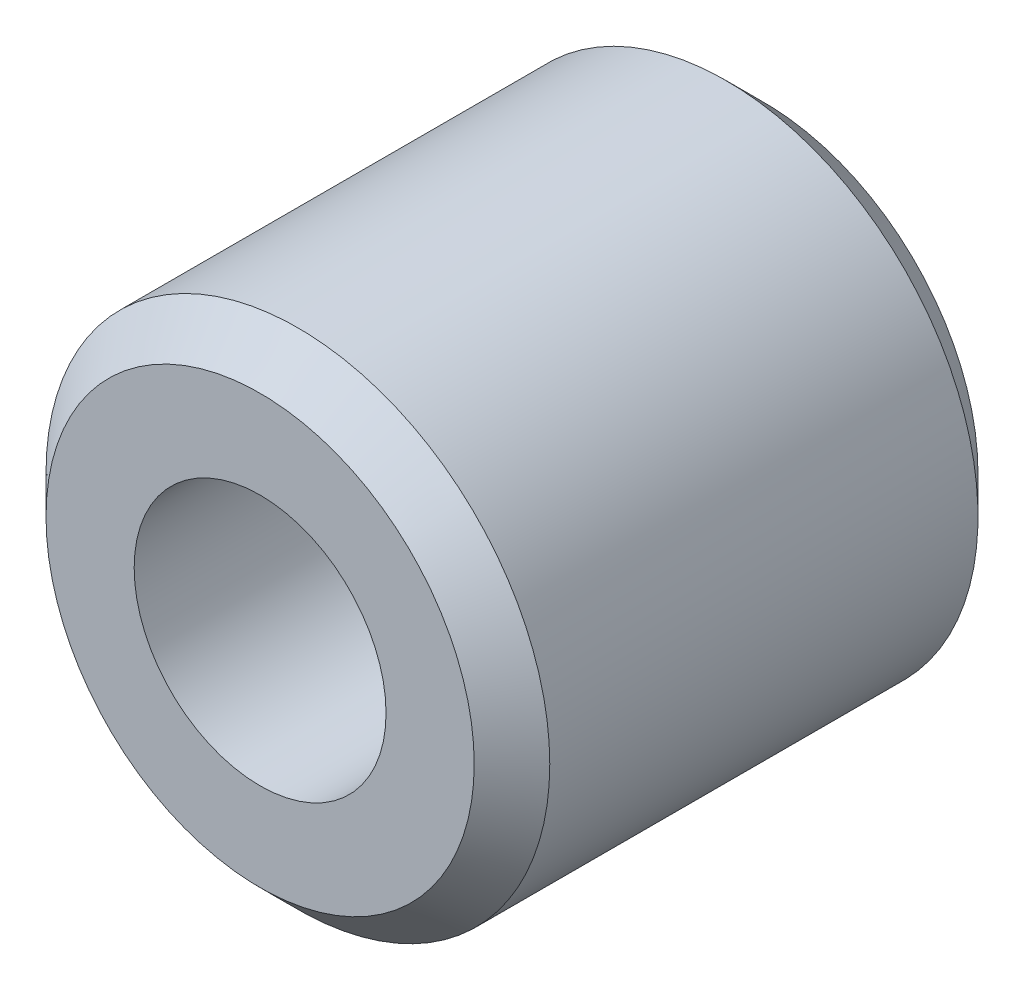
ISO-10303-21;
HEADER;
FILE_DESCRIPTION(('STEP AP214'),'2;1');
FILE_NAME('part.step','',(''),(''),'','','');
FILE_SCHEMA(('AUTOMOTIVE_DESIGN { 1 0 10303 214 1 1 1 1 }'));
ENDSEC;
DATA;
#1=APPLICATION_CONTEXT('core data for automotive mechanical design processes');
#2=APPLICATION_PROTOCOL_DEFINITION('international standard','automotive_design',2000,#1);
#3=PRODUCT_CONTEXT('',#1,'mechanical');
#4=PRODUCT('Part','Part','',(#3));
#5=PRODUCT_RELATED_PRODUCT_CATEGORY('part','',(#4));
#6=PRODUCT_DEFINITION_FORMATION('','',#4);
#7=PRODUCT_DEFINITION_CONTEXT('part definition',#1,'design');
#8=PRODUCT_DEFINITION('design','',#6,#7);
#9=PRODUCT_DEFINITION_SHAPE('','',#8);
#10=(LENGTH_UNIT() NAMED_UNIT(*) SI_UNIT(.MILLI.,.METRE.));
#11=(NAMED_UNIT(*) PLANE_ANGLE_UNIT() SI_UNIT($,.RADIAN.));
#12=(NAMED_UNIT(*) SI_UNIT($,.STERADIAN.) SOLID_ANGLE_UNIT());
#13=UNCERTAINTY_MEASURE_WITH_UNIT(LENGTH_MEASURE(1.E-05),#10,'distance_accuracy_value','');
#14=(GEOMETRIC_REPRESENTATION_CONTEXT(3) GLOBAL_UNCERTAINTY_ASSIGNED_CONTEXT((#13)) GLOBAL_UNIT_ASSIGNED_CONTEXT((#10,
#11,#12)) REPRESENTATION_CONTEXT('',''));
#15=CARTESIAN_POINT('',(0.,0.,0.));
#16=DIRECTION('',(0.,0.,1.));
#17=DIRECTION('',(1.,0.,0.));
#18=AXIS2_PLACEMENT_3D('',#15,#16,#17);
#19=CARTESIAN_POINT('',(0.,0.,0.));
#20=DIRECTION('',(0.,0.,-1.));
#21=DIRECTION('',(-1.,0.,0.));
#22=AXIS2_PLACEMENT_3D('',#19,#20,#21);
#23=CYLINDRICAL_SURFACE('',#22,3.);
#24=CARTESIAN_POINT('',(0.,0.,0.));
#25=DIRECTION('',(0.,0.,-1.));
#26=DIRECTION('',(-1.,0.,0.));
#27=AXIS2_PLACEMENT_3D('',#24,#25,#26);
#28=CIRCLE('',#27,3.);
#29=CARTESIAN_POINT('',(-3.,0.,0.));
#30=VERTEX_POINT('',#29);
#31=EDGE_CURVE('E34',#30,#30,#28,.T.);
#32=ORIENTED_EDGE('',*,*,#31,.T.);
#33=EDGE_LOOP('',(#32));
#34=FACE_BOUND('',#33,.T.);
#35=CARTESIAN_POINT('',(0.,0.,12.));
#36=DIRECTION('',(0.,0.,-1.));
#37=DIRECTION('',(-1.,0.,0.));
#38=AXIS2_PLACEMENT_3D('',#35,#36,#37);
#39=CIRCLE('',#38,3.);
#40=CARTESIAN_POINT('',(-3.,0.,12.));
#41=VERTEX_POINT('',#40);
#42=EDGE_CURVE('E31',#41,#41,#39,.T.);
#43=ORIENTED_EDGE('',*,*,#42,.F.);
#44=EDGE_LOOP('',(#43));
#45=FACE_BOUND('',#44,.T.);
#46=ADVANCED_FACE('F12',(#34,#45),#23,.F.);
#47=CARTESIAN_POINT('',(-3.,0.,12.));
#48=DIRECTION('',(0.,0.,1.));
#49=DIRECTION('',(1.,0.,0.));
#50=AXIS2_PLACEMENT_3D('',#47,#48,#49);
#51=PLANE('',#50);
#52=CARTESIAN_POINT('',(0.,0.,12.));
#53=DIRECTION('',(0.,0.,1.));
#54=DIRECTION('',(1.,0.,0.));
#55=AXIS2_PLACEMENT_3D('',#52,#53,#54);
#56=CIRCLE('',#55,5.1);
#57=CARTESIAN_POINT('',(5.1,0.,12.));
#58=VERTEX_POINT('',#57);
#59=EDGE_CURVE('E8',#58,#58,#56,.T.);
#60=ORIENTED_EDGE('',*,*,#59,.T.);
#61=EDGE_LOOP('',(#60));
#62=FACE_BOUND('',#61,.T.);
#63=ORIENTED_EDGE('',*,*,#42,.T.);
#64=EDGE_LOOP('',(#63));
#65=FACE_BOUND('',#64,.T.);
#66=ADVANCED_FACE('F55',(#62,#65),#51,.T.);
#67=CARTESIAN_POINT('',(0.,0.,0.));
#68=DIRECTION('',(0.,0.,-1.));
#69=DIRECTION('',(-1.,0.,0.));
#70=AXIS2_PLACEMENT_3D('',#67,#68,#69);
#71=CYLINDRICAL_SURFACE('',#70,6.);
#72=CARTESIAN_POINT('',(0.,0.,0.899999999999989));
#73=DIRECTION('',(0.,0.,-1.));
#74=DIRECTION('',(-1.,0.,0.));
#75=AXIS2_PLACEMENT_3D('',#72,#73,#74);
#76=CIRCLE('',#75,6.);
#77=CARTESIAN_POINT('',(-6.,0.,0.899999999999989));
#78=VERTEX_POINT('',#77);
#79=EDGE_CURVE('E18',#78,#78,#76,.F.);
#80=ORIENTED_EDGE('',*,*,#79,.T.);
#81=EDGE_LOOP('',(#80));
#82=FACE_BOUND('',#81,.T.);
#83=CARTESIAN_POINT('',(0.,0.,11.1));
#84=DIRECTION('',(0.,0.,1.));
#85=DIRECTION('',(1.,0.,0.));
#86=AXIS2_PLACEMENT_3D('',#83,#84,#85);
#87=CIRCLE('',#86,6.);
#88=CARTESIAN_POINT('',(6.,0.,11.1));
#89=VERTEX_POINT('',#88);
#90=EDGE_CURVE('E22',#89,#89,#87,.F.);
#91=ORIENTED_EDGE('',*,*,#90,.T.);
#92=EDGE_LOOP('',(#91));
#93=FACE_BOUND('',#92,.T.);
#94=ADVANCED_FACE('F43',(#82,#93),#71,.T.);
#95=CARTESIAN_POINT('',(-3.,0.,0.));
#96=DIRECTION('',(0.,0.,-1.));
#97=DIRECTION('',(-1.,0.,0.));
#98=AXIS2_PLACEMENT_3D('',#95,#96,#97);
#99=PLANE('',#98);
#100=CARTESIAN_POINT('',(0.,0.,0.));
#101=DIRECTION('',(0.,0.,-1.));
#102=DIRECTION('',(-1.,0.,0.));
#103=AXIS2_PLACEMENT_3D('',#100,#101,#102);
#104=CIRCLE('',#103,5.1);
#105=CARTESIAN_POINT('',(-5.1,0.,0.));
#106=VERTEX_POINT('',#105);
#107=EDGE_CURVE('E26',#106,#106,#104,.T.);
#108=ORIENTED_EDGE('',*,*,#107,.T.);
#109=EDGE_LOOP('',(#108));
#110=FACE_BOUND('',#109,.T.);
#111=ORIENTED_EDGE('',*,*,#31,.F.);
#112=EDGE_LOOP('',(#111));
#113=FACE_BOUND('',#112,.T.);
#114=ADVANCED_FACE('F40',(#110,#113),#99,.T.);
#115=CARTESIAN_POINT('',(0.,0.,0.));
#116=DIRECTION('',(0.,0.,1.));
#117=DIRECTION('',(1.,0.,0.));
#118=AXIS2_PLACEMENT_3D('',#115,#116,#117);
#119=CONICAL_SURFACE('',#118,5.1,0.785398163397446);
#120=ORIENTED_EDGE('',*,*,#79,.F.);
#121=EDGE_LOOP('',(#120));
#122=FACE_BOUND('',#121,.T.);
#123=ORIENTED_EDGE('',*,*,#107,.F.);
#124=EDGE_LOOP('',(#123));
#125=FACE_BOUND('',#124,.T.);
#126=ADVANCED_FACE('F42',(#122,#125),#119,.T.);
#127=CARTESIAN_POINT('',(0.,0.,11.1));
#128=DIRECTION('',(0.,0.,-1.));
#129=DIRECTION('',(-1.,0.,0.));
#130=AXIS2_PLACEMENT_3D('',#127,#128,#129);
#131=CONICAL_SURFACE('',#130,6.,0.785398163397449);
#132=ORIENTED_EDGE('',*,*,#59,.F.);
#133=EDGE_LOOP('',(#132));
#134=FACE_BOUND('',#133,.T.);
#135=ORIENTED_EDGE('',*,*,#90,.F.);
#136=EDGE_LOOP('',(#135));
#137=FACE_BOUND('',#136,.T.);
#138=ADVANCED_FACE('F52',(#134,#137),#131,.T.);
#139=CLOSED_SHELL('',(#46,#66,#94,#114,#126,#138));
#140=MANIFOLD_SOLID_BREP('B1',#139);
#141=ADVANCED_BREP_SHAPE_REPRESENTATION('',(#18,#140),#14);
#142=SHAPE_DEFINITION_REPRESENTATION(#9,#141);
ENDSEC;
END-ISO-10303-21;
